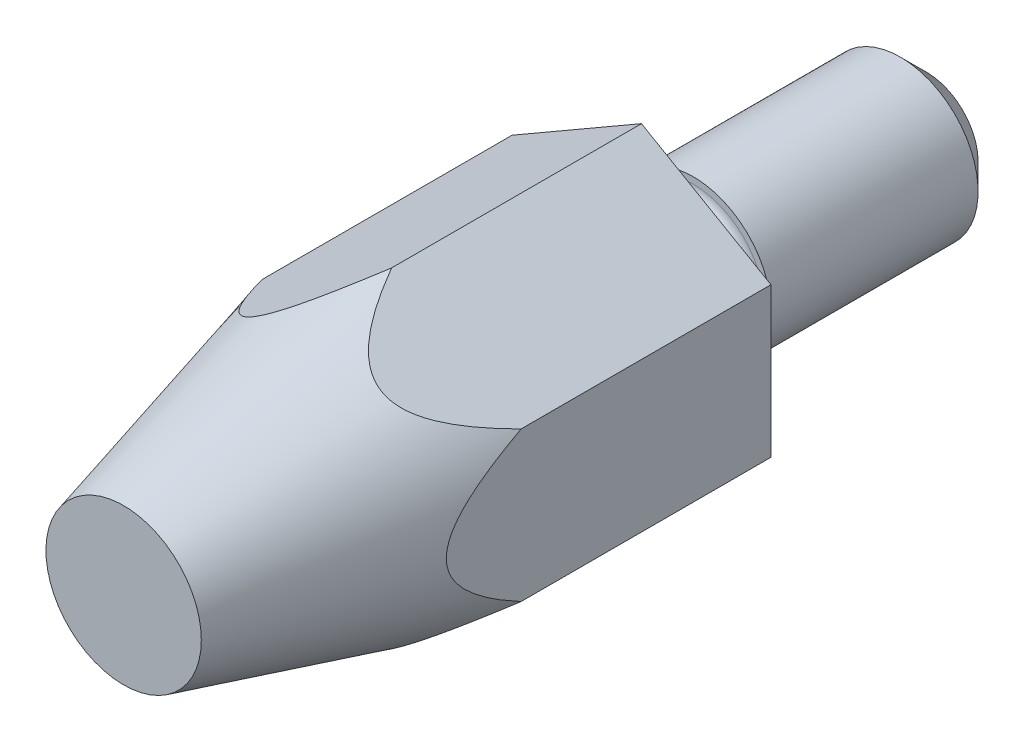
ISO-10303-21;
HEADER;
FILE_DESCRIPTION(('STEP AP214'),'2;1');
FILE_NAME('part.step','',(''),(''),'','','');
FILE_SCHEMA(('AUTOMOTIVE_DESIGN { 1 0 10303 214 1 1 1 1 }'));
ENDSEC;
DATA;
#1=APPLICATION_CONTEXT('core data for automotive mechanical design processes');
#2=APPLICATION_PROTOCOL_DEFINITION('international standard','automotive_design',2000,#1);
#3=PRODUCT_CONTEXT('',#1,'mechanical');
#4=PRODUCT('Part','Part','',(#3));
#5=PRODUCT_RELATED_PRODUCT_CATEGORY('part','',(#4));
#6=PRODUCT_DEFINITION_FORMATION('','',#4);
#7=PRODUCT_DEFINITION_CONTEXT('part definition',#1,'design');
#8=PRODUCT_DEFINITION('design','',#6,#7);
#9=PRODUCT_DEFINITION_SHAPE('','',#8);
#10=(LENGTH_UNIT() NAMED_UNIT(*) SI_UNIT(.MILLI.,.METRE.));
#11=(NAMED_UNIT(*) PLANE_ANGLE_UNIT() SI_UNIT($,.RADIAN.));
#12=(NAMED_UNIT(*) SI_UNIT($,.STERADIAN.) SOLID_ANGLE_UNIT());
#13=UNCERTAINTY_MEASURE_WITH_UNIT(LENGTH_MEASURE(1.E-05),#10,'distance_accuracy_value','');
#14=(GEOMETRIC_REPRESENTATION_CONTEXT(3) GLOBAL_UNCERTAINTY_ASSIGNED_CONTEXT((#13)) GLOBAL_UNIT_ASSIGNED_CONTEXT((#10,
#11,#12)) REPRESENTATION_CONTEXT('',''));
#15=CARTESIAN_POINT('',(0.,0.,0.));
#16=DIRECTION('',(0.,0.,1.));
#17=DIRECTION('',(1.,0.,0.));
#18=AXIS2_PLACEMENT_3D('',#15,#16,#17);
#19=CARTESIAN_POINT('',(-8.35898384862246,0.,0.));
#20=DIRECTION('',(0.,0.,-1.));
#21=DIRECTION('',(-1.,0.,0.));
#22=AXIS2_PLACEMENT_3D('',#19,#20,#21);
#23=PLANE('',#22);
#24=CARTESIAN_POINT('',(0.,0.,0.));
#25=DIRECTION('',(0.,0.,-1.));
#26=DIRECTION('',(-1.,0.,0.));
#27=AXIS2_PLACEMENT_3D('',#24,#25,#26);
#28=CIRCLE('',#27,2.75);
#29=CARTESIAN_POINT('',(-2.75,0.,0.));
#30=VERTEX_POINT('',#29);
#31=EDGE_CURVE('E22',#30,#30,#28,.F.);
#32=ORIENTED_EDGE('',*,*,#31,.T.);
#33=EDGE_LOOP('',(#32));
#34=FACE_BOUND('',#33,.T.);
#35=DIRECTION('',(0.,1.,0.));
#36=VECTOR('',#35,1.);
#37=CARTESIAN_POINT('',(5.,-2.88675134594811,0.));
#38=LINE('',#37,#36);
#39=CARTESIAN_POINT('',(5.,-2.88675134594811,0.));
#40=VERTEX_POINT('',#39);
#41=CARTESIAN_POINT('',(5.,2.88675134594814,0.));
#42=VERTEX_POINT('',#41);
#43=EDGE_CURVE('E97',#40,#42,#38,.T.);
#44=ORIENTED_EDGE('',*,*,#43,.F.);
#45=DIRECTION('',(-0.866025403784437,-0.5,0.));
#46=VECTOR('',#45,1.);
#47=CARTESIAN_POINT('',(5.,-2.88675134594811,0.));
#48=LINE('',#47,#46);
#49=CARTESIAN_POINT('',(0.,-5.77350269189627,0.));
#50=VERTEX_POINT('',#49);
#51=EDGE_CURVE('E90',#40,#50,#48,.T.);
#52=ORIENTED_EDGE('',*,*,#51,.T.);
#53=DIRECTION('',(0.866025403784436,-0.5,0.));
#54=VECTOR('',#53,1.);
#55=CARTESIAN_POINT('',(-5.,-2.88675134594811,0.));
#56=LINE('',#55,#54);
#57=CARTESIAN_POINT('',(-5.,-2.88675134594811,0.));
#58=VERTEX_POINT('',#57);
#59=EDGE_CURVE('E88',#58,#50,#56,.T.);
#60=ORIENTED_EDGE('',*,*,#59,.F.);
#61=DIRECTION('',(0.,1.,0.));
#62=VECTOR('',#61,1.);
#63=CARTESIAN_POINT('',(-5.,-2.88675134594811,0.));
#64=LINE('',#63,#62);
#65=CARTESIAN_POINT('',(-5.,2.88675134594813,0.));
#66=VERTEX_POINT('',#65);
#67=EDGE_CURVE('E37',#58,#66,#64,.T.);
#68=ORIENTED_EDGE('',*,*,#67,.T.);
#69=DIRECTION('',(0.86602540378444,0.5,0.));
#70=VECTOR('',#69,1.);
#71=CARTESIAN_POINT('',(-5.,2.88675134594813,0.));
#72=LINE('',#71,#70);
#73=CARTESIAN_POINT('',(0.,5.77350269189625,0.));
#74=VERTEX_POINT('',#73);
#75=EDGE_CURVE('E77',#66,#74,#72,.T.);
#76=ORIENTED_EDGE('',*,*,#75,.T.);
#77=DIRECTION('',(-0.86602540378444,0.5,0.));
#78=VECTOR('',#77,1.);
#79=CARTESIAN_POINT('',(5.,2.88675134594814,0.));
#80=LINE('',#79,#78);
#81=EDGE_CURVE('E83',#42,#74,#80,.T.);
#82=ORIENTED_EDGE('',*,*,#81,.F.);
#83=EDGE_LOOP('',(#44,#52,#60,#68,#76,#82));
#84=FACE_BOUND('',#83,.T.);
#85=ADVANCED_FACE('F14',(#34,#84),#23,.T.);
#86=CARTESIAN_POINT('',(5.,-2.88675134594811,20.));
#87=DIRECTION('',(0.5,-0.866025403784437,0.));
#88=DIRECTION('',(0.866025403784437,0.5,0.));
#89=AXIS2_PLACEMENT_3D('',#86,#87,#88);
#90=PLANE('',#89);
#91=DIRECTION('',(0.,0.,-1.));
#92=VECTOR('',#91,1.);
#93=CARTESIAN_POINT('',(0.,-5.77350269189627,20.));
#94=LINE('',#93,#92);
#95=CARTESIAN_POINT('',(1.0945400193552E-13,-5.77350269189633,9.64914703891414));
#96=VERTEX_POINT('',#95);
#97=EDGE_CURVE('E29',#96,#50,#94,.T.);
#98=ORIENTED_EDGE('',*,*,#97,.T.);
#99=ORIENTED_EDGE('',*,*,#51,.F.);
#100=DIRECTION('',(0.,0.,-1.));
#101=VECTOR('',#100,1.);
#102=CARTESIAN_POINT('',(5.,-2.88675134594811,20.));
#103=LINE('',#102,#101);
#104=CARTESIAN_POINT('',(5.,-2.88675134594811,9.64914703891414));
#105=VERTEX_POINT('',#104);
#106=EDGE_CURVE('E102',#105,#40,#103,.T.);
#107=ORIENTED_EDGE('',*,*,#106,.F.);
#108=CARTESIAN_POINT('',(-0.000200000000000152,-5.77361816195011,9.64871608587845));
#109=CARTESIAN_POINT('',(0.066613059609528,-5.73504362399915,9.79254886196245));
#110=CARTESIAN_POINT('',(0.134906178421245,-5.6956145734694,9.93551032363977));
#111=CARTESIAN_POINT('',(0.275434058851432,-5.61448076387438,10.2191728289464));
#112=CARTESIAN_POINT('',(0.347675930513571,-5.57277189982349,10.3598691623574));
#113=CARTESIAN_POINT('',(0.497724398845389,-5.48614137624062,10.6395900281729));
#114=CARTESIAN_POINT('',(0.575586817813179,-5.4411874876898,10.7785749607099));
#115=CARTESIAN_POINT('',(0.73735650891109,-5.34778971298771,11.0516683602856));
#116=CARTESIAN_POINT('',(0.821258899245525,-5.29934864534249,11.18578063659));
#117=CARTESIAN_POINT('',(0.99214017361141,-5.20069029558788,11.4397396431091));
#118=CARTESIAN_POINT('',(1.07869243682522,-5.1507193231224,11.5599651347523));
#119=CARTESIAN_POINT('',(1.2610601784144,-5.04542925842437,11.7907555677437));
#120=CARTESIAN_POINT('',(1.35686724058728,-4.99011502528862,11.9013291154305));
#121=CARTESIAN_POINT('',(1.53855912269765,-4.88521516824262,12.0843797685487));
#122=CARTESIAN_POINT('',(1.62209200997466,-4.83698743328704,12.1599190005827));
#123=CARTESIAN_POINT('',(1.79796539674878,-4.73544688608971,12.2958936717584));
#124=CARTESIAN_POINT('',(1.89027927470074,-4.68214944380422,12.3563728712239));
#125=CARTESIAN_POINT('',(2.0517153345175,-4.58894429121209,12.4382038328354));
#126=CARTESIAN_POINT('',(2.11839657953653,-4.55044585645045,12.4658805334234));
#127=CARTESIAN_POINT('',(2.2547866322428,-4.4717010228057,12.5082892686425));
#128=CARTESIAN_POINT('',(2.3244912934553,-4.4314570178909,12.5230384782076));
#129=CARTESIAN_POINT('',(2.46550457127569,-4.35004296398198,12.5377872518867));
#130=CARTESIAN_POINT('',(2.53682005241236,-4.30886895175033,12.537702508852));
#131=CARTESIAN_POINT('',(2.67824468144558,-4.22721740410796,12.5225881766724));
#132=CARTESIAN_POINT('',(2.74835306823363,-4.18674030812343,12.5075494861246));
#133=CARTESIAN_POINT('',(2.89986836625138,-4.09926291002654,12.459900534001));
#134=CARTESIAN_POINT('',(2.98054352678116,-4.05268508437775,12.4242556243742));
#135=CARTESIAN_POINT('',(3.13596876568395,-3.96295028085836,12.3386611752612));
#136=CARTESIAN_POINT('',(3.21070482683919,-3.91980139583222,12.2886790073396));
#137=CARTESIAN_POINT('',(3.34625548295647,-3.84154118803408,12.1847989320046));
#138=CARTESIAN_POINT('',(3.40769326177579,-3.80607006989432,12.1319585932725));
#139=CARTESIAN_POINT('',(3.52646632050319,-3.73749641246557,12.020397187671));
#140=CARTESIAN_POINT('',(3.58379786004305,-3.70439603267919,11.9616708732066));
#141=CARTESIAN_POINT('',(3.69525082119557,-3.6400486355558,11.8394570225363));
#142=CARTESIAN_POINT('',(3.74934683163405,-3.60881628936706,11.7759389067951));
#143=CARTESIAN_POINT('',(3.85438937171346,-3.54816995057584,11.6455958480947));
#144=CARTESIAN_POINT('',(3.90533715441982,-3.51875523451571,11.5787722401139));
#145=CARTESIAN_POINT('',(4.06016343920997,-3.42936623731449,11.3663017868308));
#146=CARTESIAN_POINT('',(4.15942927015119,-3.37205508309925,11.2161804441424));
#147=CARTESIAN_POINT('',(4.34940257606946,-3.26237394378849,10.9087198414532));
#148=CARTESIAN_POINT('',(4.4400969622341,-3.21001151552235,10.7513700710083));
#149=CARTESIAN_POINT('',(4.61166845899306,-3.11095466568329,10.4378332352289));
#150=CARTESIAN_POINT('',(4.69278505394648,-3.06412197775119,10.2818199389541));
#151=CARTESIAN_POINT('',(4.8107322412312,-2.9960251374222,10.0456907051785));
#152=CARTESIAN_POINT('',(4.84936626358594,-2.97371977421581,9.96676079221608));
#153=CARTESIAN_POINT('',(4.9255584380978,-2.92973020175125,9.808224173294));
#154=CARTESIAN_POINT('',(4.96311672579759,-2.90804591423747,9.72861755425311));
#155=CARTESIAN_POINT('',(5.00020000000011,-2.88663587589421,9.64871608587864));
#156=B_SPLINE_CURVE_WITH_KNOTS('',3,(#108,#109,#110,#111,#112,#113,#114,#115,#116,#117,#118,
#119,#120,#121,#122,#123,#124,#125,#126,#127,#128,#129,#130,#131,#132,#133,#134,#135,#136,#137,
#138,#139,#140,#141,#142,#143,#144,#145,#146,#147,#148,#149,#150,#151,#152,#153,#154,#155),
.UNSPECIFIED.,.F.,.F.,(4,2,2,2,2,2,2,2,2,2,2,2,2,2,2,2,2,2,2,2,2,2,2,4),(0.,0.489700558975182,
0.98031393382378,1.47674422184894,1.97277768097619,2.44138411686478,2.90956834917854,
3.27625130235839,3.64185600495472,3.88641289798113,4.13064438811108,4.37626398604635,
4.62203316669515,4.91958488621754,5.21781921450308,5.48280887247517,5.74803691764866,
6.01513022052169,6.28211652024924,6.84806715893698,7.4148685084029,7.96062387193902,
8.23260942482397,8.50456055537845),.UNSPECIFIED.);
#157=EDGE_CURVE('E157',#96,#105,#156,.T.);
#158=ORIENTED_EDGE('',*,*,#157,.F.);
#159=EDGE_LOOP('',(#98,#99,#107,#158));
#160=FACE_BOUND('',#159,.T.);
#161=ADVANCED_FACE('F127',(#160),#90,.T.);
#162=CARTESIAN_POINT('',(5.,-2.88675134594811,20.));
#163=DIRECTION('',(-1.,0.,0.));
#164=DIRECTION('',(0.,0.,1.));
#165=AXIS2_PLACEMENT_3D('',#162,#163,#164);
#166=PLANE('',#165);
#167=CARTESIAN_POINT('',(5.,-6.17550562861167,1.54175724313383));
#168=CARTESIAN_POINT('',(5.,-6.05566468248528,1.88928023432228));
#169=CARTESIAN_POINT('',(5.,-5.93463519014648,2.23639905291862));
#170=CARTESIAN_POINT('',(5.,-5.68962033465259,2.92964140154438));
#171=CARTESIAN_POINT('',(5.,-5.56563459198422,3.27576479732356));
#172=CARTESIAN_POINT('',(5.,-5.31349281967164,3.96857026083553));
#173=CARTESIAN_POINT('',(5.,-5.18531817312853,4.31524557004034));
#174=CARTESIAN_POINT('',(5.,-4.9246344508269,5.00693697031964));
#175=CARTESIAN_POINT('',(5.,-4.79212570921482,5.35195318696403));
#176=CARTESIAN_POINT('',(5.,-4.51363933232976,6.06031534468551));
#177=CARTESIAN_POINT('',(5.,-4.36732935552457,6.42353101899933));
#178=CARTESIAN_POINT('',(5.,-4.06675632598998,7.1467873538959));
#179=CARTESIAN_POINT('',(5.,-3.9124914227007,7.50682725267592));
#180=CARTESIAN_POINT('',(5.,-3.67321304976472,8.04285199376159));
#181=CARTESIAN_POINT('',(5.,-3.59224279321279,8.22064172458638));
#182=CARTESIAN_POINT('',(5.,-3.4271064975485,8.57472783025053));
#183=CARTESIAN_POINT('',(5.,-3.3429405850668,8.75102426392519));
#184=CARTESIAN_POINT('',(5.,-3.17079967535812,9.1016640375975));
#185=CARTESIAN_POINT('',(5.,-3.08282623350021,9.27600813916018));
#186=CARTESIAN_POINT('',(5.,-2.90218273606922,9.62223743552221));
#187=CARTESIAN_POINT('',(5.,-2.80951327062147,9.79412293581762));
#188=CARTESIAN_POINT('',(5.,-2.66955997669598,10.0432782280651));
#189=CARTESIAN_POINT('',(5.,-2.62459134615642,10.1218495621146));
#190=CARTESIAN_POINT('',(5.,-2.53322409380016,10.2781565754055));
#191=CARTESIAN_POINT('',(5.,-2.48682545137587,10.3558922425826));
#192=CARTESIAN_POINT('',(5.,-2.34515929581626,10.5877516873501));
#193=CARTESIAN_POINT('',(5.,-2.24747941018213,10.7404237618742));
#194=CARTESIAN_POINT('',(5.,-2.04385601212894,11.0401096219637));
#195=CARTESIAN_POINT('',(5.,-1.93791578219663,11.1871256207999));
#196=CARTESIAN_POINT('',(5.,-1.71507406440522,11.4725360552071));
#197=CARTESIAN_POINT('',(5.,-1.59818691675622,11.6109413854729));
#198=CARTESIAN_POINT('',(5.,-1.4103133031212,11.8091133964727));
#199=CARTESIAN_POINT('',(5.,-1.34494834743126,11.8741418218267));
#200=CARTESIAN_POINT('',(5.,-1.20960574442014,11.9991774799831));
#201=CARTESIAN_POINT('',(5.,-1.13962496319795,12.0591812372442));
#202=CARTESIAN_POINT('',(5.,-0.922837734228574,12.2280067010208));
#203=CARTESIAN_POINT('',(5.,-0.76766302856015,12.3273719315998));
#204=CARTESIAN_POINT('',(5.,-0.525675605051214,12.4351184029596));
#205=CARTESIAN_POINT('',(5.,-0.447864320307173,12.4635428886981));
#206=CARTESIAN_POINT('',(5.,-0.288530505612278,12.5072003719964));
#207=CARTESIAN_POINT('',(5.,-0.207009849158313,12.5224399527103));
#208=CARTESIAN_POINT('',(5.,-0.0420406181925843,12.5377843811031));
#209=CARTESIAN_POINT('',(5.,0.0414162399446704,12.5378033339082));
#210=CARTESIAN_POINT('',(5.,0.206884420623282,12.5224905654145));
#211=CARTESIAN_POINT('',(5.,0.288895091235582,12.5071520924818));
#212=CARTESIAN_POINT('',(5.,0.465036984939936,12.4587750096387));
#213=CARTESIAN_POINT('',(5.,0.558351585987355,12.4228323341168));
#214=CARTESIAN_POINT('',(5.,0.738092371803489,12.3366360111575));
#215=CARTESIAN_POINT('',(5.,0.824502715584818,12.2863505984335));
#216=CARTESIAN_POINT('',(5.,0.981330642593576,12.1818257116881));
#217=CARTESIAN_POINT('',(5.,1.05246170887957,12.1286304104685));
#218=CARTESIAN_POINT('',(5.,1.18996109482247,12.0163511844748));
#219=CARTESIAN_POINT('',(5.,1.2563251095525,11.9572620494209));
#220=CARTESIAN_POINT('',(5.,1.38543959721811,11.8342119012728));
#221=CARTESIAN_POINT('',(5.,1.44815339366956,11.7702128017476));
#222=CARTESIAN_POINT('',(5.,1.56991526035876,11.6389074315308));
#223=CARTESIAN_POINT('',(5.,1.62896522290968,11.5716029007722));
#224=CARTESIAN_POINT('',(5.,1.7927398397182,11.3762813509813));
#225=CARTESIAN_POINT('',(5.,1.89375411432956,11.2451589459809));
#226=CARTESIAN_POINT('',(5.,2.08787316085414,10.9771436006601));
#227=CARTESIAN_POINT('',(5.,2.18097189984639,10.8402463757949));
#228=CARTESIAN_POINT('',(5.,2.36128511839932,10.5619573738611));
#229=CARTESIAN_POINT('',(5.,2.44847734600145,10.420551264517));
#230=CARTESIAN_POINT('',(5.,2.61789628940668,10.1347912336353));
#231=CARTESIAN_POINT('',(5.,2.70012236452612,9.99043693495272));
#232=CARTESIAN_POINT('',(5.,2.85451786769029,9.71040389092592));
#233=CARTESIAN_POINT('',(5.,2.92697922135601,9.57488533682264));
#234=CARTESIAN_POINT('',(5.,3.06899904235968,9.30232238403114));
#235=CARTESIAN_POINT('',(5.,3.1385572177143,9.1652778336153));
#236=CARTESIAN_POINT('',(5.,3.27461207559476,8.89115242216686));
#237=CARTESIAN_POINT('',(5.,3.34112998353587,8.75408206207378));
#238=CARTESIAN_POINT('',(5.,3.47204356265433,8.47896861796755));
#239=CARTESIAN_POINT('',(5.,3.5364397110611,8.34092576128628));
#240=CARTESIAN_POINT('',(5.,3.5999437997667,8.20248027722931));
#241=B_SPLINE_CURVE_WITH_KNOTS('',3,(#167,#168,#169,#170,#171,#172,#173,#174,#175,#176,#177,
#178,#179,#180,#181,#182,#183,#184,#185,#186,#187,#188,#189,#190,#191,#192,#193,#194,#195,#196,
#197,#198,#199,#200,#201,#202,#203,#204,#205,#206,#207,#208,#209,#210,#211,#212,#213,#214,#215,
#216,#217,#218,#219,#220,#221,#222,#223,#224,#225,#226,#227,#228,#229,#230,#231,#232,#233,#234,
#235,#236,#237,#238,#239,#240),.UNSPECIFIED.,.F.,.F.,(4,2,2,2,2,2,2,2,2,2,2,2,2,2,2,2,2,2,2,2,2,
2,2,2,2,2,2,2,2,2,2,2,2,2,2,2,4),(0.,1.10282353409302,2.20578941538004,3.31459991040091,
4.42332511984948,5.5979922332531,6.77293385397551,7.35898832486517,7.94501959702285,
8.53081369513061,9.11653436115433,9.38810985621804,9.6596892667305,10.2032052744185,
10.7465063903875,11.2891054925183,11.5654501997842,11.8419845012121,12.3881920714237,
12.6358085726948,12.8833013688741,13.1321908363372,13.3811897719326,13.6795069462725,
13.9784900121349,14.2445695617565,14.5108864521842,14.7795323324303,15.0480382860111,
15.544135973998,16.0406084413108,16.5388577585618,17.0371712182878,17.4981548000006,
17.9591846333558,18.4162394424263,18.8731907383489),.UNSPECIFIED.);
#242=CARTESIAN_POINT('',(5.,2.88675134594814,9.64914703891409));
#243=VERTEX_POINT('',#242);
#244=EDGE_CURVE('E151',#243,#105,#241,.F.);
#245=ORIENTED_EDGE('',*,*,#244,.T.);
#246=ORIENTED_EDGE('',*,*,#106,.T.);
#247=ORIENTED_EDGE('',*,*,#43,.T.);
#248=DIRECTION('',(0.,0.,-1.));
#249=VECTOR('',#248,1.);
#250=CARTESIAN_POINT('',(5.,2.88675134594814,20.));
#251=LINE('',#250,#249);
#252=EDGE_CURVE('E100',#243,#42,#251,.T.);
#253=ORIENTED_EDGE('',*,*,#252,.F.);
#254=EDGE_LOOP('',(#245,#246,#247,#253));
#255=FACE_BOUND('',#254,.T.);
#256=ADVANCED_FACE('F163',(#255),#166,.F.);
#257=CARTESIAN_POINT('',(5.,2.88675134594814,20.));
#258=DIRECTION('',(-0.5,-0.86602540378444,0.));
#259=DIRECTION('',(0.86602540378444,-0.5,0.));
#260=AXIS2_PLACEMENT_3D('',#257,#258,#259);
#261=PLANE('',#260);
#262=CARTESIAN_POINT('',(-0.000199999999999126,5.77361816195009,9.64871608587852));
#263=CARTESIAN_POINT('',(0.0666130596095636,5.73504362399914,9.79254886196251));
#264=CARTESIAN_POINT('',(0.134906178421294,5.69561457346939,9.93551032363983));
#265=CARTESIAN_POINT('',(0.275434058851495,5.61448076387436,10.2191728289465));
#266=CARTESIAN_POINT('',(0.347675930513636,5.57277189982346,10.3598691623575));
#267=CARTESIAN_POINT('',(0.497724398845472,5.48614137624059,10.639590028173));
#268=CARTESIAN_POINT('',(0.575586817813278,5.44118748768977,10.77857496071));
#269=CARTESIAN_POINT('',(0.737356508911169,5.34778971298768,11.0516683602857));
#270=CARTESIAN_POINT('',(0.821258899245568,5.29934864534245,11.1857806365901));
#271=CARTESIAN_POINT('',(0.992140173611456,5.20069029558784,11.4397396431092));
#272=CARTESIAN_POINT('',(1.0786924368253,5.15071932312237,11.5599651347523));
#273=CARTESIAN_POINT('',(1.26106017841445,5.04542925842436,11.7907555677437));
#274=CARTESIAN_POINT('',(1.35686724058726,4.99011502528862,11.9013291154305));
#275=CARTESIAN_POINT('',(1.53855912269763,4.88521516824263,12.0843797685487));
#276=CARTESIAN_POINT('',(1.62209200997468,4.83698743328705,12.1599190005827));
#277=CARTESIAN_POINT('',(1.79796539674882,4.7354468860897,12.2958936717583));
#278=CARTESIAN_POINT('',(1.89027927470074,4.68214944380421,12.3563728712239));
#279=CARTESIAN_POINT('',(2.05171533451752,4.58894429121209,12.4382038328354));
#280=CARTESIAN_POINT('',(2.11839657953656,4.55044585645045,12.4658805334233));
#281=CARTESIAN_POINT('',(2.25478663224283,4.4717010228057,12.5082892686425));
#282=CARTESIAN_POINT('',(2.32449129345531,4.43145701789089,12.5230384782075));
#283=CARTESIAN_POINT('',(2.4655045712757,4.35004296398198,12.5377872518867));
#284=CARTESIAN_POINT('',(2.53682005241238,4.30886895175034,12.537702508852));
#285=CARTESIAN_POINT('',(2.67824468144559,4.22721740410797,12.5225881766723));
#286=CARTESIAN_POINT('',(2.74835306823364,4.18674030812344,12.5075494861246));
#287=CARTESIAN_POINT('',(2.89986836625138,4.09926291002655,12.459900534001));
#288=CARTESIAN_POINT('',(2.98054352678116,4.05268508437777,12.4242556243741));
#289=CARTESIAN_POINT('',(3.13596876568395,3.96295028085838,12.3386611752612));
#290=CARTESIAN_POINT('',(3.21070482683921,3.91980139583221,12.2886790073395));
#291=CARTESIAN_POINT('',(3.34625548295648,3.84154118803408,12.1847989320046));
#292=CARTESIAN_POINT('',(3.40769326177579,3.80607006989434,12.1319585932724));
#293=CARTESIAN_POINT('',(3.52646632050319,3.7374964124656,12.0203971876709));
#294=CARTESIAN_POINT('',(3.58379786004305,3.70439603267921,11.9616708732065));
#295=CARTESIAN_POINT('',(3.69525082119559,3.64004863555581,11.8394570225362));
#296=CARTESIAN_POINT('',(3.74934683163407,3.60881628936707,11.775938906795));
#297=CARTESIAN_POINT('',(3.85438937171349,3.54816995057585,11.6455958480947));
#298=CARTESIAN_POINT('',(3.90533715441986,3.51875523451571,11.5787722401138));
#299=CARTESIAN_POINT('',(4.06016343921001,3.42936623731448,11.3663017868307));
#300=CARTESIAN_POINT('',(4.15942927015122,3.37205508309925,11.2161804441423));
#301=CARTESIAN_POINT('',(4.34940257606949,3.2623739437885,10.9087198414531));
#302=CARTESIAN_POINT('',(4.44009696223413,3.21001151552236,10.7513700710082));
#303=CARTESIAN_POINT('',(4.61166845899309,3.1109546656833,10.4378332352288));
#304=CARTESIAN_POINT('',(4.69278505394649,3.06412197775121,10.281819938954));
#305=CARTESIAN_POINT('',(4.81073224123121,2.99602513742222,10.0456907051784));
#306=CARTESIAN_POINT('',(4.84936626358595,2.97371977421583,9.96676079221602));
#307=CARTESIAN_POINT('',(4.9255584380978,2.92973020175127,9.80822417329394));
#308=CARTESIAN_POINT('',(4.96311672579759,2.90804591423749,9.72861755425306));
#309=CARTESIAN_POINT('',(5.00020000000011,2.88663587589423,9.64871608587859));
#310=B_SPLINE_CURVE_WITH_KNOTS('',3,(#262,#263,#264,#265,#266,#267,#268,#269,#270,#271,#272,
#273,#274,#275,#276,#277,#278,#279,#280,#281,#282,#283,#284,#285,#286,#287,#288,#289,#290,#291,
#292,#293,#294,#295,#296,#297,#298,#299,#300,#301,#302,#303,#304,#305,#306,#307,#308,#309),
.UNSPECIFIED.,.F.,.F.,(4,2,2,2,2,2,2,2,2,2,2,2,2,2,2,2,2,2,2,2,2,2,2,4),(0.,0.489700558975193,
0.980313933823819,1.476744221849,1.97277768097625,2.44138411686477,2.90956834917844,
3.27625130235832,3.64185600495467,3.88641289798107,4.130644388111,4.37626398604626,
4.62203316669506,4.91958488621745,5.21781921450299,5.48280887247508,5.74803691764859,
6.01513022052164,6.28211652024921,6.84806715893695,7.41486850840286,7.96062387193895,
8.23260942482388,8.50456055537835),.UNSPECIFIED.);
#311=CARTESIAN_POINT('',(0.,5.77350269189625,9.64914703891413));
#312=VERTEX_POINT('',#311);
#313=EDGE_CURVE('E145',#312,#243,#310,.T.);
#314=ORIENTED_EDGE('',*,*,#313,.T.);
#315=ORIENTED_EDGE('',*,*,#252,.T.);
#316=ORIENTED_EDGE('',*,*,#81,.T.);
#317=DIRECTION('',(0.,0.,-1.));
#318=VECTOR('',#317,1.);
#319=CARTESIAN_POINT('',(0.,5.77350269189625,20.));
#320=LINE('',#319,#318);
#321=EDGE_CURVE('E73',#312,#74,#320,.T.);
#322=ORIENTED_EDGE('',*,*,#321,.F.);
#323=EDGE_LOOP('',(#314,#315,#316,#322));
#324=FACE_BOUND('',#323,.T.);
#325=ADVANCED_FACE('F136',(#324),#261,.F.);
#326=CARTESIAN_POINT('',(-5.,2.88675134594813,20.));
#327=DIRECTION('',(-0.5,0.86602540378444,0.));
#328=DIRECTION('',(-0.86602540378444,-0.5,0.));
#329=AXIS2_PLACEMENT_3D('',#326,#327,#328);
#330=PLANE('',#329);
#331=ORIENTED_EDGE('',*,*,#321,.T.);
#332=ORIENTED_EDGE('',*,*,#75,.F.);
#333=DIRECTION('',(0.,0.,-1.));
#334=VECTOR('',#333,1.);
#335=CARTESIAN_POINT('',(-5.,2.88675134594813,20.));
#336=LINE('',#335,#334);
#337=CARTESIAN_POINT('',(-5.,2.88675134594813,9.6491470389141));
#338=VERTEX_POINT('',#337);
#339=EDGE_CURVE('E66',#338,#66,#336,.T.);
#340=ORIENTED_EDGE('',*,*,#339,.F.);
#341=CARTESIAN_POINT('',(0.000200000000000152,5.77361816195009,9.64871608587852));
#342=CARTESIAN_POINT('',(-0.0666130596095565,5.73504362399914,9.79254886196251));
#343=CARTESIAN_POINT('',(-0.134906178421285,5.69561457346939,9.93551032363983));
#344=CARTESIAN_POINT('',(-0.275434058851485,5.61448076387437,10.2191728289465));
#345=CARTESIAN_POINT('',(-0.347675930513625,5.57277189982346,10.3598691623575));
#346=CARTESIAN_POINT('',(-0.497724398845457,5.48614137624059,10.639590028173));
#347=CARTESIAN_POINT('',(-0.575586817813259,5.44118748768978,10.77857496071));
#348=CARTESIAN_POINT('',(-0.737356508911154,5.34778971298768,11.0516683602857));
#349=CARTESIAN_POINT('',(-0.821258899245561,5.29934864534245,11.1857806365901));
#350=CARTESIAN_POINT('',(-0.992140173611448,5.20069029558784,11.4397396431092));
#351=CARTESIAN_POINT('',(-1.07869243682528,5.15071932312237,11.5599651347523));
#352=CARTESIAN_POINT('',(-1.26106017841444,5.04542925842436,11.7907555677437));
#353=CARTESIAN_POINT('',(-1.35686724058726,4.99011502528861,11.9013291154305));
#354=CARTESIAN_POINT('',(-1.53855912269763,4.88521516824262,12.0843797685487));
#355=CARTESIAN_POINT('',(-1.62209200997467,4.83698743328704,12.1599190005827));
#356=CARTESIAN_POINT('',(-1.79796539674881,4.7354468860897,12.2958936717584));
#357=CARTESIAN_POINT('',(-1.89027927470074,4.68214944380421,12.3563728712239));
#358=CARTESIAN_POINT('',(-2.05171533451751,4.58894429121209,12.4382038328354));
#359=CARTESIAN_POINT('',(-2.11839657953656,4.55044585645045,12.4658805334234));
#360=CARTESIAN_POINT('',(-2.25478663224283,4.4717010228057,12.5082892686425));
#361=CARTESIAN_POINT('',(-2.32449129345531,4.43145701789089,12.5230384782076));
#362=CARTESIAN_POINT('',(-2.4655045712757,4.35004296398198,12.5377872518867));
#363=CARTESIAN_POINT('',(-2.53682005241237,4.30886895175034,12.537702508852));
#364=CARTESIAN_POINT('',(-2.67824468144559,4.22721740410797,12.5225881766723));
#365=CARTESIAN_POINT('',(-2.74835306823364,4.18674030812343,12.5075494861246));
#366=CARTESIAN_POINT('',(-2.89986836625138,4.09926291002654,12.459900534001));
#367=CARTESIAN_POINT('',(-2.98054352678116,4.05268508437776,12.4242556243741));
#368=CARTESIAN_POINT('',(-3.13596876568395,3.96295028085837,12.3386611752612));
#369=CARTESIAN_POINT('',(-3.21070482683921,3.91980139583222,12.2886790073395));
#370=CARTESIAN_POINT('',(-3.34625548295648,3.84154118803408,12.1847989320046));
#371=CARTESIAN_POINT('',(-3.4076932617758,3.80607006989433,12.1319585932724));
#372=CARTESIAN_POINT('',(-3.5264663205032,3.73749641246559,12.0203971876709));
#373=CARTESIAN_POINT('',(-3.58379786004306,3.7043960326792,11.9616708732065));
#374=CARTESIAN_POINT('',(-3.69525082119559,3.6400486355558,11.8394570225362));
#375=CARTESIAN_POINT('',(-3.74934683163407,3.60881628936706,11.7759389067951));
#376=CARTESIAN_POINT('',(-3.85438937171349,3.54816995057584,11.6455958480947));
#377=CARTESIAN_POINT('',(-3.90533715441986,3.51875523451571,11.5787722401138));
#378=CARTESIAN_POINT('',(-4.06016343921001,3.42936623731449,11.3663017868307));
#379=CARTESIAN_POINT('',(-4.15942927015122,3.37205508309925,11.2161804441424));
#380=CARTESIAN_POINT('',(-4.34940257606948,3.2623739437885,10.9087198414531));
#381=CARTESIAN_POINT('',(-4.44009696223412,3.21001151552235,10.7513700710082));
#382=CARTESIAN_POINT('',(-4.61166845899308,3.1109546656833,10.4378332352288));
#383=CARTESIAN_POINT('',(-4.69278505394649,3.0641219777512,10.281819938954));
#384=CARTESIAN_POINT('',(-4.81073224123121,2.99602513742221,10.0456907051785));
#385=CARTESIAN_POINT('',(-4.84936626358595,2.97371977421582,9.96676079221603));
#386=CARTESIAN_POINT('',(-4.9255584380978,2.92973020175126,9.80822417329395));
#387=CARTESIAN_POINT('',(-4.96311672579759,2.90804591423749,9.72861755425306));
#388=CARTESIAN_POINT('',(-5.00020000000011,2.88663587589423,9.64871608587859));
#389=B_SPLINE_CURVE_WITH_KNOTS('',3,(#341,#342,#343,#344,#345,#346,#347,#348,#349,#350,#351,
#352,#353,#354,#355,#356,#357,#358,#359,#360,#361,#362,#363,#364,#365,#366,#367,#368,#369,#370,
#371,#372,#373,#374,#375,#376,#377,#378,#379,#380,#381,#382,#383,#384,#385,#386,#387,#388),
.UNSPECIFIED.,.F.,.F.,(4,2,2,2,2,2,2,2,2,2,2,2,2,2,2,2,2,2,2,2,2,2,2,4),(0.,0.489700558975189,
0.980313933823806,1.47674422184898,1.97277768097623,2.44138411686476,2.90956834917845,
3.27625130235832,3.64185600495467,3.88641289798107,4.13064438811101,4.37626398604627,
4.62203316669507,4.91958488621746,5.217819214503,5.4828088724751,5.74803691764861,
6.01513022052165,6.28211652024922,6.84806715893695,7.41486850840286,7.96062387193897,
8.2326094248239,8.50456055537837),.UNSPECIFIED.);
#390=EDGE_CURVE('E139',#312,#338,#389,.T.);
#391=ORIENTED_EDGE('',*,*,#390,.F.);
#392=EDGE_LOOP('',(#331,#332,#340,#391));
#393=FACE_BOUND('',#392,.T.);
#394=ADVANCED_FACE('F78',(#393),#330,.T.);
#395=CARTESIAN_POINT('',(-5.,-2.88675134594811,20.));
#396=DIRECTION('',(-1.,0.,0.));
#397=DIRECTION('',(0.,0.,1.));
#398=AXIS2_PLACEMENT_3D('',#395,#396,#397);
#399=PLANE('',#398);
#400=ORIENTED_EDGE('',*,*,#339,.T.);
#401=ORIENTED_EDGE('',*,*,#67,.F.);
#402=DIRECTION('',(0.,0.,-1.));
#403=VECTOR('',#402,1.);
#404=CARTESIAN_POINT('',(-5.,-2.88675134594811,20.));
#405=LINE('',#404,#403);
#406=CARTESIAN_POINT('',(-5.,-2.88675134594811,9.64914703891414));
#407=VERTEX_POINT('',#406);
#408=EDGE_CURVE('E74',#407,#58,#405,.T.);
#409=ORIENTED_EDGE('',*,*,#408,.F.);
#410=CARTESIAN_POINT('',(-5.,-6.17550562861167,1.54175724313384));
#411=CARTESIAN_POINT('',(-5.,-6.05566468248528,1.88928023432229));
#412=CARTESIAN_POINT('',(-5.,-5.93463519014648,2.23639905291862));
#413=CARTESIAN_POINT('',(-5.,-5.68962033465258,2.92964140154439));
#414=CARTESIAN_POINT('',(-5.,-5.56563459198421,3.27576479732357));
#415=CARTESIAN_POINT('',(-5.,-5.31349281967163,3.96857026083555));
#416=CARTESIAN_POINT('',(-5.,-5.18531817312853,4.31524557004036));
#417=CARTESIAN_POINT('',(-5.,-4.9246344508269,5.00693697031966));
#418=CARTESIAN_POINT('',(-5.,-4.79212570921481,5.35195318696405));
#419=CARTESIAN_POINT('',(-5.,-4.51363933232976,6.06031534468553));
#420=CARTESIAN_POINT('',(-5.,-4.36732935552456,6.42353101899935));
#421=CARTESIAN_POINT('',(-5.,-4.06675632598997,7.14678735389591));
#422=CARTESIAN_POINT('',(-5.,-3.91249142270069,7.50682725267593));
#423=CARTESIAN_POINT('',(-5.,-3.67321304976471,8.04285199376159));
#424=CARTESIAN_POINT('',(-5.,-3.59224279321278,8.22064172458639));
#425=CARTESIAN_POINT('',(-5.,-3.4271064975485,8.57472783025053));
#426=CARTESIAN_POINT('',(-5.,-3.34294058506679,8.75102426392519));
#427=CARTESIAN_POINT('',(-5.,-3.17079967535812,9.1016640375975));
#428=CARTESIAN_POINT('',(-5.,-3.08282623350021,9.27600813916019));
#429=CARTESIAN_POINT('',(-5.,-2.90218273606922,9.62223743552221));
#430=CARTESIAN_POINT('',(-5.,-2.80951327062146,9.79412293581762));
#431=CARTESIAN_POINT('',(-5.,-2.66955997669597,10.0432782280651));
#432=CARTESIAN_POINT('',(-5.,-2.62459134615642,10.1218495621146));
#433=CARTESIAN_POINT('',(-5.,-2.53322409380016,10.2781565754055));
#434=CARTESIAN_POINT('',(-5.,-2.48682545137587,10.3558922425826));
#435=CARTESIAN_POINT('',(-5.,-2.34515929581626,10.5877516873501));
#436=CARTESIAN_POINT('',(-5.,-2.24747941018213,10.7404237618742));
#437=CARTESIAN_POINT('',(-5.,-2.04385601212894,11.0401096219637));
#438=CARTESIAN_POINT('',(-5.,-1.93791578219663,11.1871256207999));
#439=CARTESIAN_POINT('',(-5.,-1.71507406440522,11.472536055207));
#440=CARTESIAN_POINT('',(-5.,-1.59818691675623,11.6109413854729));
#441=CARTESIAN_POINT('',(-5.,-1.41031330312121,11.8091133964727));
#442=CARTESIAN_POINT('',(-5.,-1.34494834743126,11.8741418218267));
#443=CARTESIAN_POINT('',(-5.,-1.20960574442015,11.9991774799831));
#444=CARTESIAN_POINT('',(-5.,-1.13962496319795,12.0591812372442));
#445=CARTESIAN_POINT('',(-5.,-0.922837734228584,12.2280067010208));
#446=CARTESIAN_POINT('',(-5.,-0.767663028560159,12.3273719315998));
#447=CARTESIAN_POINT('',(-5.,-0.525675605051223,12.4351184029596));
#448=CARTESIAN_POINT('',(-5.,-0.447864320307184,12.4635428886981));
#449=CARTESIAN_POINT('',(-5.,-0.288530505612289,12.5072003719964));
#450=CARTESIAN_POINT('',(-5.,-0.207009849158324,12.5224399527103));
#451=CARTESIAN_POINT('',(-5.,-0.0420406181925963,12.5377843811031));
#452=CARTESIAN_POINT('',(-5.,0.0414162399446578,12.5378033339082));
#453=CARTESIAN_POINT('',(-5.,0.206884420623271,12.5224905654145));
#454=CARTESIAN_POINT('',(-5.,0.288895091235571,12.5071520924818));
#455=CARTESIAN_POINT('',(-5.,0.465036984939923,12.4587750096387));
#456=CARTESIAN_POINT('',(-5.,0.558351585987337,12.4228323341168));
#457=CARTESIAN_POINT('',(-5.,0.73809237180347,12.3366360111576));
#458=CARTESIAN_POINT('',(-5.,0.824502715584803,12.2863505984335));
#459=CARTESIAN_POINT('',(-5.,0.981330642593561,12.1818257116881));
#460=CARTESIAN_POINT('',(-5.,1.05246170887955,12.1286304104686));
#461=CARTESIAN_POINT('',(-5.,1.18996109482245,12.0163511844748));
#462=CARTESIAN_POINT('',(-5.,1.25632510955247,11.9572620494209));
#463=CARTESIAN_POINT('',(-5.,1.38543959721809,11.8342119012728));
#464=CARTESIAN_POINT('',(-5.,1.44815339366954,11.7702128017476));
#465=CARTESIAN_POINT('',(-5.,1.56991526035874,11.6389074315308));
#466=CARTESIAN_POINT('',(-5.,1.62896522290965,11.5716029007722));
#467=CARTESIAN_POINT('',(-5.,1.79273983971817,11.3762813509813));
#468=CARTESIAN_POINT('',(-5.,1.89375411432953,11.2451589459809));
#469=CARTESIAN_POINT('',(-5.,2.08787316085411,10.9771436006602));
#470=CARTESIAN_POINT('',(-5.,2.18097189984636,10.8402463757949));
#471=CARTESIAN_POINT('',(-5.,2.36128511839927,10.5619573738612));
#472=CARTESIAN_POINT('',(-5.,2.4484773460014,10.420551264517));
#473=CARTESIAN_POINT('',(-5.,2.61789628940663,10.1347912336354));
#474=CARTESIAN_POINT('',(-5.,2.70012236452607,9.99043693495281));
#475=CARTESIAN_POINT('',(-5.,2.85451786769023,9.71040389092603));
#476=CARTESIAN_POINT('',(-5.,2.92697922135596,9.57488533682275));
#477=CARTESIAN_POINT('',(-5.,3.06899904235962,9.30232238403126));
#478=CARTESIAN_POINT('',(-5.,3.13855721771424,9.16527783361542));
#479=CARTESIAN_POINT('',(-5.,3.2746120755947,8.89115242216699));
#480=CARTESIAN_POINT('',(-5.,3.3411299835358,8.75408206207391));
#481=CARTESIAN_POINT('',(-5.,3.47204356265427,8.47896861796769));
#482=CARTESIAN_POINT('',(-5.,3.53643971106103,8.34092576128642));
#483=CARTESIAN_POINT('',(-5.,3.59994379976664,8.20248027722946));
#484=B_SPLINE_CURVE_WITH_KNOTS('',3,(#410,#411,#412,#413,#414,#415,#416,#417,#418,#419,#420,
#421,#422,#423,#424,#425,#426,#427,#428,#429,#430,#431,#432,#433,#434,#435,#436,#437,#438,#439,
#440,#441,#442,#443,#444,#445,#446,#447,#448,#449,#450,#451,#452,#453,#454,#455,#456,#457,#458,
#459,#460,#461,#462,#463,#464,#465,#466,#467,#468,#469,#470,#471,#472,#473,#474,#475,#476,#477,
#478,#479,#480,#481,#482,#483),.UNSPECIFIED.,.F.,.F.,(4,2,2,2,2,2,2,2,2,2,2,2,2,2,2,2,2,2,2,2,2,
2,2,2,2,2,2,2,2,2,2,2,2,2,2,2,4),(0.,1.10282353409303,2.20578941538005,3.31459991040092,
4.4233251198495,5.59799223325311,6.77293385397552,7.35898832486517,7.94501959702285,
8.53081369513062,9.11653436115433,9.38810985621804,9.6596892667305,10.2032052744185,
10.7465063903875,11.2891054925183,11.5654501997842,11.841984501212,12.3881920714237,
12.6358085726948,12.8833013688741,13.1321908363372,13.3811897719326,13.6795069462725,
13.9784900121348,14.2445695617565,14.5108864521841,14.7795323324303,15.0480382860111,
15.5441359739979,16.0406084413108,16.5388577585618,17.0371712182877,17.4981548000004,
17.9591846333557,18.4162394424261,18.8731907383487),.UNSPECIFIED.);
#485=EDGE_CURVE('E70',#338,#407,#484,.F.);
#486=ORIENTED_EDGE('',*,*,#485,.F.);
#487=EDGE_LOOP('',(#400,#401,#409,#486));
#488=FACE_BOUND('',#487,.T.);
#489=ADVANCED_FACE('F68',(#488),#399,.T.);
#490=CARTESIAN_POINT('',(-5.,-2.88675134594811,20.));
#491=DIRECTION('',(0.5,0.866025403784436,0.));
#492=DIRECTION('',(-0.866025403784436,0.5,0.));
#493=AXIS2_PLACEMENT_3D('',#490,#491,#492);
#494=PLANE('',#493);
#495=CARTESIAN_POINT('',(0.000199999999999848,-5.77361816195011,9.64871608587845));
#496=CARTESIAN_POINT('',(-0.0666130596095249,-5.73504362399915,9.79254886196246));
#497=CARTESIAN_POINT('',(-0.134906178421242,-5.6956145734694,9.93551032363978));
#498=CARTESIAN_POINT('',(-0.275434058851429,-5.61448076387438,10.2191728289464));
#499=CARTESIAN_POINT('',(-0.347675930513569,-5.57277189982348,10.3598691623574));
#500=CARTESIAN_POINT('',(-0.497724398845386,-5.48614137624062,10.6395900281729));
#501=CARTESIAN_POINT('',(-0.575586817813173,-5.44118748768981,10.7785749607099));
#502=CARTESIAN_POINT('',(-0.737356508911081,-5.34778971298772,11.0516683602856));
#503=CARTESIAN_POINT('',(-0.821258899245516,-5.29934864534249,11.18578063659));
#504=CARTESIAN_POINT('',(-0.992140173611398,-5.20069029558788,11.4397396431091));
#505=CARTESIAN_POINT('',(-1.0786924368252,-5.1507193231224,11.5599651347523));
#506=CARTESIAN_POINT('',(-1.2610601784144,-5.04542925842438,11.7907555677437));
#507=CARTESIAN_POINT('',(-1.35686724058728,-4.99011502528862,11.9013291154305));
#508=CARTESIAN_POINT('',(-1.53855912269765,-4.88521516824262,12.0843797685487));
#509=CARTESIAN_POINT('',(-1.62209200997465,-4.83698743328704,12.1599190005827));
#510=CARTESIAN_POINT('',(-1.79796539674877,-4.73544688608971,12.2958936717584));
#511=CARTESIAN_POINT('',(-1.89027927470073,-4.68214944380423,12.3563728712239));
#512=CARTESIAN_POINT('',(-2.05171533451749,-4.5889442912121,12.4382038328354));
#513=CARTESIAN_POINT('',(-2.11839657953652,-4.55044585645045,12.4658805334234));
#514=CARTESIAN_POINT('',(-2.25478663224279,-4.4717010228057,12.5082892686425));
#515=CARTESIAN_POINT('',(-2.32449129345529,-4.43145701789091,12.5230384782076));
#516=CARTESIAN_POINT('',(-2.46550457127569,-4.35004296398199,12.5377872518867));
#517=CARTESIAN_POINT('',(-2.53682005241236,-4.30886895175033,12.537702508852));
#518=CARTESIAN_POINT('',(-2.67824468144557,-4.22721740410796,12.5225881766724));
#519=CARTESIAN_POINT('',(-2.74835306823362,-4.18674030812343,12.5075494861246));
#520=CARTESIAN_POINT('',(-2.89986836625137,-4.09926291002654,12.459900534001));
#521=CARTESIAN_POINT('',(-2.98054352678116,-4.05268508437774,12.4242556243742));
#522=CARTESIAN_POINT('',(-3.13596876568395,-3.96295028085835,12.3386611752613));
#523=CARTESIAN_POINT('',(-3.21070482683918,-3.91980139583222,12.2886790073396));
#524=CARTESIAN_POINT('',(-3.34625548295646,-3.84154118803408,12.1847989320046));
#525=CARTESIAN_POINT('',(-3.40769326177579,-3.80607006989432,12.1319585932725));
#526=CARTESIAN_POINT('',(-3.52646632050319,-3.73749641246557,12.020397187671));
#527=CARTESIAN_POINT('',(-3.58379786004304,-3.70439603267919,11.9616708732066));
#528=CARTESIAN_POINT('',(-3.69525082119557,-3.6400486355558,11.8394570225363));
#529=CARTESIAN_POINT('',(-3.74934683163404,-3.60881628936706,11.7759389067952));
#530=CARTESIAN_POINT('',(-3.85438937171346,-3.54816995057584,11.6455958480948));
#531=CARTESIAN_POINT('',(-3.90533715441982,-3.51875523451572,11.5787722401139));
#532=CARTESIAN_POINT('',(-4.06016343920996,-3.4293662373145,11.3663017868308));
#533=CARTESIAN_POINT('',(-4.15942927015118,-3.37205508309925,11.2161804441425));
#534=CARTESIAN_POINT('',(-4.34940257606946,-3.26237394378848,10.9087198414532));
#535=CARTESIAN_POINT('',(-4.4400969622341,-3.21001151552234,10.7513700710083));
#536=CARTESIAN_POINT('',(-4.61166845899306,-3.11095466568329,10.4378332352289));
#537=CARTESIAN_POINT('',(-4.69278505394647,-3.06412197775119,10.2818199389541));
#538=CARTESIAN_POINT('',(-4.8107322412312,-2.99602513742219,10.0456907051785));
#539=CARTESIAN_POINT('',(-4.84936626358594,-2.9737197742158,9.96676079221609));
#540=CARTESIAN_POINT('',(-4.9255584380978,-2.92973020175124,9.80822417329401));
#541=CARTESIAN_POINT('',(-4.96311672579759,-2.90804591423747,9.72861755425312));
#542=CARTESIAN_POINT('',(-5.00020000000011,-2.88663587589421,9.64871608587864));
#543=B_SPLINE_CURVE_WITH_KNOTS('',3,(#495,#496,#497,#498,#499,#500,#501,#502,#503,#504,#505,
#506,#507,#508,#509,#510,#511,#512,#513,#514,#515,#516,#517,#518,#519,#520,#521,#522,#523,#524,
#525,#526,#527,#528,#529,#530,#531,#532,#533,#534,#535,#536,#537,#538,#539,#540,#541,#542),
.UNSPECIFIED.,.F.,.F.,(4,2,2,2,2,2,2,2,2,2,2,2,2,2,2,2,2,2,2,2,2,2,2,4),(0.,0.489700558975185,
0.980313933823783,1.47674422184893,1.97277768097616,2.44138411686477,2.90956834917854,
3.27625130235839,3.64185600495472,3.88641289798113,4.13064438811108,4.37626398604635,
4.62203316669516,4.91958488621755,5.21781921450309,5.48280887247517,5.74803691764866,
6.01513022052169,6.28211652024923,6.84806715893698,7.41486850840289,7.96062387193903,
8.23260942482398,8.50456055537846),.UNSPECIFIED.);
#544=EDGE_CURVE('E104',#96,#407,#543,.T.);
#545=ORIENTED_EDGE('',*,*,#544,.T.);
#546=ORIENTED_EDGE('',*,*,#408,.T.);
#547=ORIENTED_EDGE('',*,*,#59,.T.);
#548=ORIENTED_EDGE('',*,*,#97,.F.);
#549=EDGE_LOOP('',(#545,#546,#547,#548));
#550=FACE_BOUND('',#549,.T.);
#551=ADVANCED_FACE('F122',(#550),#494,.F.);
#552=CARTESIAN_POINT('',(0.,0.,20.));
#553=DIRECTION('',(0.,0.,1.));
#554=DIRECTION('',(1.,0.,0.));
#555=AXIS2_PLACEMENT_3D('',#552,#553,#554);
#556=PLANE('',#555);
#557=CARTESIAN_POINT('',(0.,0.,20.));
#558=DIRECTION('',(0.,0.,1.));
#559=DIRECTION('',(1.,0.,0.));
#560=AXIS2_PLACEMENT_3D('',#557,#558,#559);
#561=CIRCLE('',#560,3.);
#562=CARTESIAN_POINT('',(3.,0.,20.));
#563=VERTEX_POINT('',#562);
#564=EDGE_CURVE('E200',#563,#563,#561,.T.);
#565=ORIENTED_EDGE('',*,*,#564,.T.);
#566=EDGE_LOOP('',(#565));
#567=FACE_BOUND('',#566,.T.);
#568=ADVANCED_FACE('F126',(#567),#556,.T.);
#569=CARTESIAN_POINT('',(0.,0.,20.));
#570=DIRECTION('',(0.,0.,-1.));
#571=DIRECTION('',(-1.,0.,0.));
#572=AXIS2_PLACEMENT_3D('',#569,#570,#571);
#573=CONICAL_SURFACE('',#572,3.,0.26179938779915);
#574=ORIENTED_EDGE('',*,*,#564,.F.);
#575=EDGE_LOOP('',(#574));
#576=FACE_BOUND('',#575,.T.);
#577=ORIENTED_EDGE('',*,*,#544,.F.);
#578=ORIENTED_EDGE('',*,*,#157,.T.);
#579=ORIENTED_EDGE('',*,*,#244,.F.);
#580=ORIENTED_EDGE('',*,*,#313,.F.);
#581=ORIENTED_EDGE('',*,*,#390,.T.);
#582=ORIENTED_EDGE('',*,*,#485,.T.);
#583=EDGE_LOOP('',(#577,#578,#579,#580,#581,#582));
#584=FACE_BOUND('',#583,.T.);
#585=ADVANCED_FACE('F118',(#576,#584),#573,.T.);
#586=CARTESIAN_POINT('',(0.,0.,-2.));
#587=DIRECTION('',(0.,0.,-1.));
#588=DIRECTION('',(-1.,0.,0.));
#589=AXIS2_PLACEMENT_3D('',#586,#587,#588);
#590=PLANE('',#589);
#591=CARTESIAN_POINT('',(0.,0.,-2.));
#592=DIRECTION('',(0.,0.,-1.));
#593=DIRECTION('',(-1.,0.,0.));
#594=AXIS2_PLACEMENT_3D('',#591,#592,#593);
#595=CIRCLE('',#594,2.75);
#596=CARTESIAN_POINT('',(-2.75,0.,-2.));
#597=VERTEX_POINT('',#596);
#598=EDGE_CURVE('E9',#597,#597,#595,.T.);
#599=ORIENTED_EDGE('',*,*,#598,.T.);
#600=EDGE_LOOP('',(#599));
#601=FACE_BOUND('',#600,.T.);
#602=CARTESIAN_POINT('',(0.,0.,-2.));
#603=DIRECTION('',(0.,0.,-1.));
#604=DIRECTION('',(-1.,0.,0.));
#605=AXIS2_PLACEMENT_3D('',#602,#603,#604);
#606=CIRCLE('',#605,3.);
#607=CARTESIAN_POINT('',(-3.,0.,-2.));
#608=VERTEX_POINT('',#607);
#609=EDGE_CURVE('E95',#608,#608,#606,.F.);
#610=ORIENTED_EDGE('',*,*,#609,.T.);
#611=EDGE_LOOP('',(#610));
#612=FACE_BOUND('',#611,.T.);
#613=ADVANCED_FACE('F251',(#601,#612),#590,.F.);
#614=CARTESIAN_POINT('',(0.,0.,-2.));
#615=DIRECTION('',(0.,0.,1.));
#616=DIRECTION('',(1.,0.,0.));
#617=AXIS2_PLACEMENT_3D('',#614,#615,#616);
#618=CYLINDRICAL_SURFACE('',#617,2.25);
#619=CARTESIAN_POINT('',(0.,0.,-0.5));
#620=DIRECTION('',(0.,0.,-1.));
#621=DIRECTION('',(-1.,0.,0.));
#622=AXIS2_PLACEMENT_3D('',#619,#620,#621);
#623=CIRCLE('',#622,2.25);
#624=CARTESIAN_POINT('',(-2.25,0.,-0.5));
#625=VERTEX_POINT('',#624);
#626=EDGE_CURVE('E187',#625,#625,#623,.T.);
#627=ORIENTED_EDGE('',*,*,#626,.T.);
#628=EDGE_LOOP('',(#627));
#629=FACE_BOUND('',#628,.T.);
#630=CARTESIAN_POINT('',(0.,0.,-1.5));
#631=DIRECTION('',(0.,0.,-1.));
#632=DIRECTION('',(-1.,0.,0.));
#633=AXIS2_PLACEMENT_3D('',#630,#631,#632);
#634=CIRCLE('',#633,2.25);
#635=CARTESIAN_POINT('',(-2.25,0.,-1.5));
#636=VERTEX_POINT('',#635);
#637=EDGE_CURVE('E189',#636,#636,#634,.F.);
#638=ORIENTED_EDGE('',*,*,#637,.T.);
#639=EDGE_LOOP('',(#638));
#640=FACE_BOUND('',#639,.T.);
#641=ADVANCED_FACE('F172',(#629,#640),#618,.T.);
#642=CARTESIAN_POINT('',(-3.,0.,-11.));
#643=DIRECTION('',(0.,0.,-1.));
#644=DIRECTION('',(-1.,0.,0.));
#645=AXIS2_PLACEMENT_3D('',#642,#643,#644);
#646=PLANE('',#645);
#647=CARTESIAN_POINT('',(0.,0.,-11.));
#648=DIRECTION('',(0.,0.,-1.));
#649=DIRECTION('',(-1.,0.,0.));
#650=AXIS2_PLACEMENT_3D('',#647,#648,#649);
#651=CIRCLE('',#650,2.);
#652=CARTESIAN_POINT('',(-2.,0.,-11.));
#653=VERTEX_POINT('',#652);
#654=EDGE_CURVE('E194',#653,#653,#651,.T.);
#655=ORIENTED_EDGE('',*,*,#654,.T.);
#656=EDGE_LOOP('',(#655));
#657=FACE_BOUND('',#656,.T.);
#658=ADVANCED_FACE('F168',(#657),#646,.T.);
#659=CARTESIAN_POINT('',(0.,0.,40.));
#660=DIRECTION('',(0.,0.,1.));
#661=DIRECTION('',(1.,0.,0.));
#662=AXIS2_PLACEMENT_3D('',#659,#660,#661);
#663=CYLINDRICAL_SURFACE('',#662,3.);
#664=CARTESIAN_POINT('',(0.,0.,-10.));
#665=DIRECTION('',(0.,0.,-1.));
#666=DIRECTION('',(-1.,0.,0.));
#667=AXIS2_PLACEMENT_3D('',#664,#665,#666);
#668=CIRCLE('',#667,3.);
#669=CARTESIAN_POINT('',(-3.,0.,-10.));
#670=VERTEX_POINT('',#669);
#671=EDGE_CURVE('E197',#670,#670,#668,.F.);
#672=ORIENTED_EDGE('',*,*,#671,.T.);
#673=EDGE_LOOP('',(#672));
#674=FACE_BOUND('',#673,.T.);
#675=ORIENTED_EDGE('',*,*,#609,.F.);
#676=EDGE_LOOP('',(#675));
#677=FACE_BOUND('',#676,.T.);
#678=ADVANCED_FACE('F171',(#674,#677),#663,.T.);
#679=CARTESIAN_POINT('',(0.,0.,-10.));
#680=DIRECTION('',(0.,0.,1.));
#681=DIRECTION('',(1.,0.,0.));
#682=AXIS2_PLACEMENT_3D('',#679,#680,#681);
#683=CONICAL_SURFACE('',#682,3.,0.785398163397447);
#684=ORIENTED_EDGE('',*,*,#654,.F.);
#685=EDGE_LOOP('',(#684));
#686=FACE_BOUND('',#685,.T.);
#687=ORIENTED_EDGE('',*,*,#671,.F.);
#688=EDGE_LOOP('',(#687));
#689=FACE_BOUND('',#688,.T.);
#690=ADVANCED_FACE('F175',(#686,#689),#683,.T.);
#691=CARTESIAN_POINT('',(0.,0.,-0.5));
#692=DIRECTION('',(0.,0.,-1.));
#693=DIRECTION('',(-1.,0.,0.));
#694=AXIS2_PLACEMENT_3D('',#691,#692,#693);
#695=TOROIDAL_SURFACE('',#694,2.75,0.5);
#696=ORIENTED_EDGE('',*,*,#31,.F.);
#697=EDGE_LOOP('',(#696));
#698=FACE_BOUND('',#697,.T.);
#699=ORIENTED_EDGE('',*,*,#626,.F.);
#700=EDGE_LOOP('',(#699));
#701=FACE_BOUND('',#700,.T.);
#702=ADVANCED_FACE('F284',(#698,#701),#695,.F.);
#703=CARTESIAN_POINT('',(0.,0.,-1.5));
#704=DIRECTION('',(0.,0.,-1.));
#705=DIRECTION('',(-1.,0.,0.));
#706=AXIS2_PLACEMENT_3D('',#703,#704,#705);
#707=TOROIDAL_SURFACE('',#706,2.75,0.5);
#708=ORIENTED_EDGE('',*,*,#637,.F.);
#709=EDGE_LOOP('',(#708));
#710=FACE_BOUND('',#709,.T.);
#711=ORIENTED_EDGE('',*,*,#598,.F.);
#712=EDGE_LOOP('',(#711));
#713=FACE_BOUND('',#712,.T.);
#714=ADVANCED_FACE('F16',(#710,#713),#707,.F.);
#715=CLOSED_SHELL('',(#85,#161,#256,#325,#394,#489,#551,#568,#585,#613,#641,#658,#678,#690,#702,#714));
#716=MANIFOLD_SOLID_BREP('B1',#715);
#717=ADVANCED_BREP_SHAPE_REPRESENTATION('',(#18,#716),#14);
#718=SHAPE_DEFINITION_REPRESENTATION(#9,#717);
ENDSEC;
END-ISO-10303-21;
